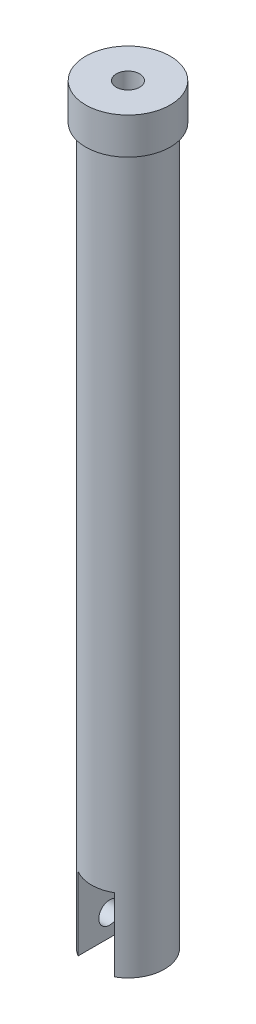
ISO-10303-21;
HEADER;
FILE_DESCRIPTION(('STEP AP214'),'2;1');
FILE_NAME('part.step','',(''),(''),'','','');
FILE_SCHEMA(('AUTOMOTIVE_DESIGN { 1 0 10303 214 1 1 1 1 }'));
ENDSEC;
DATA;
#1=APPLICATION_CONTEXT('core data for automotive mechanical design processes');
#2=APPLICATION_PROTOCOL_DEFINITION('international standard','automotive_design',2000,#1);
#3=PRODUCT_CONTEXT('',#1,'mechanical');
#4=PRODUCT('Part','Part','',(#3));
#5=PRODUCT_RELATED_PRODUCT_CATEGORY('part','',(#4));
#6=PRODUCT_DEFINITION_FORMATION('','',#4);
#7=PRODUCT_DEFINITION_CONTEXT('part definition',#1,'design');
#8=PRODUCT_DEFINITION('design','',#6,#7);
#9=PRODUCT_DEFINITION_SHAPE('','',#8);
#10=(LENGTH_UNIT() NAMED_UNIT(*) SI_UNIT(.MILLI.,.METRE.));
#11=(NAMED_UNIT(*) PLANE_ANGLE_UNIT() SI_UNIT($,.RADIAN.));
#12=(NAMED_UNIT(*) SI_UNIT($,.STERADIAN.) SOLID_ANGLE_UNIT());
#13=UNCERTAINTY_MEASURE_WITH_UNIT(LENGTH_MEASURE(1.E-05),#10,'distance_accuracy_value','');
#14=(GEOMETRIC_REPRESENTATION_CONTEXT(3) GLOBAL_UNCERTAINTY_ASSIGNED_CONTEXT((#13)) GLOBAL_UNIT_ASSIGNED_CONTEXT((#10,
#11,#12)) REPRESENTATION_CONTEXT('',''));
#15=CARTESIAN_POINT('',(0.,0.,0.));
#16=DIRECTION('',(0.,0.,1.));
#17=DIRECTION('',(1.,0.,0.));
#18=AXIS2_PLACEMENT_3D('',#15,#16,#17);
#19=CARTESIAN_POINT('',(0.,875.,0.));
#20=DIRECTION('',(0.,-1.,0.));
#21=DIRECTION('',(0.,0.,-1.));
#22=AXIS2_PLACEMENT_3D('',#19,#20,#21);
#23=CYLINDRICAL_SURFACE('',#22,50.);
#24=CARTESIAN_POINT('',(0.,-5.,0.));
#25=DIRECTION('',(0.,-1.,0.));
#26=DIRECTION('',(0.,0.,-1.));
#27=AXIS2_PLACEMENT_3D('',#24,#25,#26);
#28=CIRCLE('',#27,50.);
#29=CARTESIAN_POINT('',(-25.,-5.,-43.3012701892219));
#30=VERTEX_POINT('',#29);
#31=CARTESIAN_POINT('',(25.,-5.,-43.3012701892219));
#32=VERTEX_POINT('',#31);
#33=EDGE_CURVE('E125',#30,#32,#28,.T.);
#34=ORIENTED_EDGE('',*,*,#33,.F.);
#35=DIRECTION('',(0.,1.,0.));
#36=VECTOR('',#35,1.);
#37=CARTESIAN_POINT('',(-25.,-105.,-43.3012701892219));
#38=LINE('',#37,#36);
#39=CARTESIAN_POINT('',(-25.,-105.,-43.3012701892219));
#40=VERTEX_POINT('',#39);
#41=EDGE_CURVE('E128',#40,#30,#38,.T.);
#42=ORIENTED_EDGE('',*,*,#41,.F.);
#43=CARTESIAN_POINT('',(0.,-105.,0.));
#44=DIRECTION('',(0.,-1.,0.));
#45=DIRECTION('',(0.,0.,-1.));
#46=AXIS2_PLACEMENT_3D('',#43,#44,#45);
#47=CIRCLE('',#46,50.);
#48=CARTESIAN_POINT('',(-25.,-105.,43.3012701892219));
#49=VERTEX_POINT('',#48);
#50=EDGE_CURVE('E111',#49,#40,#47,.T.);
#51=ORIENTED_EDGE('',*,*,#50,.F.);
#52=DIRECTION('',(0.,1.,0.));
#53=VECTOR('',#52,1.);
#54=CARTESIAN_POINT('',(-25.,-105.,43.3012701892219));
#55=LINE('',#54,#53);
#56=CARTESIAN_POINT('',(-25.,-5.,43.3012701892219));
#57=VERTEX_POINT('',#56);
#58=EDGE_CURVE('E120',#49,#57,#55,.T.);
#59=ORIENTED_EDGE('',*,*,#58,.T.);
#60=CARTESIAN_POINT('',(25.,-5.,43.3012701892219));
#61=VERTEX_POINT('',#60);
#62=EDGE_CURVE('E109',#61,#57,#28,.T.);
#63=ORIENTED_EDGE('',*,*,#62,.F.);
#64=DIRECTION('',(0.,1.,0.));
#65=VECTOR('',#64,1.);
#66=CARTESIAN_POINT('',(25.,-105.,43.3012701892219));
#67=LINE('',#66,#65);
#68=CARTESIAN_POINT('',(25.,-105.,43.3012701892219));
#69=VERTEX_POINT('',#68);
#70=EDGE_CURVE('E67',#69,#61,#67,.T.);
#71=ORIENTED_EDGE('',*,*,#70,.F.);
#72=CARTESIAN_POINT('',(0.,-105.,0.));
#73=DIRECTION('',(0.,-1.,0.));
#74=DIRECTION('',(0.,0.,-1.));
#75=AXIS2_PLACEMENT_3D('',#72,#73,#74);
#76=CIRCLE('',#75,50.);
#77=CARTESIAN_POINT('',(25.,-105.,-43.3012701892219));
#78=VERTEX_POINT('',#77);
#79=EDGE_CURVE('E100',#78,#69,#76,.T.);
#80=ORIENTED_EDGE('',*,*,#79,.F.);
#81=DIRECTION('',(0.,1.,0.));
#82=VECTOR('',#81,1.);
#83=CARTESIAN_POINT('',(25.,-105.,-43.3012701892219));
#84=LINE('',#83,#82);
#85=EDGE_CURVE('E97',#78,#32,#84,.T.);
#86=ORIENTED_EDGE('',*,*,#85,.T.);
#87=EDGE_LOOP('',(#34,#42,#51,#59,#63,#71,#80,#86));
#88=FACE_BOUND('',#87,.T.);
#89=CARTESIAN_POINT('',(0.,875.,0.));
#90=DIRECTION('',(0.,1.,0.));
#91=DIRECTION('',(0.,0.,1.));
#92=AXIS2_PLACEMENT_3D('',#89,#90,#91);
#93=CIRCLE('',#92,50.);
#94=CARTESIAN_POINT('',(0.,875.,50.));
#95=VERTEX_POINT('',#94);
#96=EDGE_CURVE('E13',#95,#95,#93,.T.);
#97=ORIENTED_EDGE('',*,*,#96,.F.);
#98=EDGE_LOOP('',(#97));
#99=FACE_BOUND('',#98,.T.);
#100=CARTESIAN_POINT('',(-47.6969600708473,-75.,15.));
#101=CARTESIAN_POINT('',(-47.6969606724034,-74.5890111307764,14.9999991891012));
#102=CARTESIAN_POINT('',(-47.7022865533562,-74.1780081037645,14.9830945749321));
#103=CARTESIAN_POINT('',(-47.7234235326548,-73.3590372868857,14.9156320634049));
#104=CARTESIAN_POINT('',(-47.7392351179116,-72.9510696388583,14.86507260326));
#105=CARTESIAN_POINT('',(-47.7808538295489,-72.1410395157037,14.730748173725));
#106=CARTESIAN_POINT('',(-47.8066638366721,-71.7389787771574,14.6469736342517));
#107=CARTESIAN_POINT('',(-47.8674843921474,-70.9437376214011,14.4469666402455));
#108=CARTESIAN_POINT('',(-47.9024948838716,-70.5505571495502,14.3307343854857));
#109=CARTESIAN_POINT('',(-47.9805982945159,-69.7764103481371,14.0670197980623));
#110=CARTESIAN_POINT('',(-48.0236773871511,-69.3954244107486,13.9195908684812));
#111=CARTESIAN_POINT('',(-48.1167044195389,-68.6474432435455,13.5945325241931));
#112=CARTESIAN_POINT('',(-48.1666523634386,-68.280448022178,13.4169030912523));
#113=CARTESIAN_POINT('',(-48.2720144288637,-67.5627001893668,13.0327386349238));
#114=CARTESIAN_POINT('',(-48.3274290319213,-67.2119490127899,12.8262010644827));
#115=CARTESIAN_POINT('',(-48.4422081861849,-66.5288170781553,12.3856475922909));
#116=CARTESIAN_POINT('',(-48.5015729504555,-66.196437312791,12.1516302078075));
#117=CARTESIAN_POINT('',(-48.6244076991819,-65.54277956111,11.650553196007));
#118=CARTESIAN_POINT('',(-48.6879465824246,-65.2220929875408,11.3827386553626));
#119=CARTESIAN_POINT('',(-48.8157802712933,-64.6042422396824,10.8213882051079));
#120=CARTESIAN_POINT('',(-48.8800750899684,-64.3070784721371,10.5278518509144));
#121=CARTESIAN_POINT('',(-49.0076845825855,-63.7381158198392,9.91686644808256));
#122=CARTESIAN_POINT('',(-49.0709991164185,-63.4663205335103,9.59941401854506));
#123=CARTESIAN_POINT('',(-49.1949304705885,-62.949936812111,8.9426215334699));
#124=CARTESIAN_POINT('',(-49.255547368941,-62.7053475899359,8.60328211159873));
#125=CARTESIAN_POINT('',(-49.373666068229,-62.2402762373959,7.89757572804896));
#126=CARTESIAN_POINT('',(-49.4310771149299,-62.0203997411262,7.53079401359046));
#127=CARTESIAN_POINT('',(-49.5397653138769,-61.6124303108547,6.77907492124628));
#128=CARTESIAN_POINT('',(-49.5910423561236,-61.4243379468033,6.39413721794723));
#129=CARTESIAN_POINT('',(-49.6859862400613,-61.0815098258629,5.60884546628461));
#130=CARTESIAN_POINT('',(-49.7296543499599,-60.9267685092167,5.20849400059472));
#131=CARTESIAN_POINT('',(-49.8081209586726,-60.6519592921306,4.39521812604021));
#132=CARTESIAN_POINT('',(-49.8429197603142,-60.531890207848,3.98229414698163));
#133=CARTESIAN_POINT('',(-49.9017691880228,-60.3304540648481,3.15893611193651));
#134=CARTESIAN_POINT('',(-49.9260987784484,-60.2480782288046,2.74876867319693));
#135=CARTESIAN_POINT('',(-49.9647368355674,-60.1178359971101,1.92252240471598));
#136=CARTESIAN_POINT('',(-49.9790454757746,-60.0699690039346,1.50644367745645));
#137=CARTESIAN_POINT('',(-49.9972325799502,-60.0091992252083,0.671588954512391));
#138=CARTESIAN_POINT('',(-50.0011129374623,-59.9962900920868,0.252813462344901));
#139=CARTESIAN_POINT('',(-49.9983376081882,-60.0055414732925,-0.584310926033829));
#140=CARTESIAN_POINT('',(-49.9916821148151,-60.0277013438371,-1.00265982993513));
#141=CARTESIAN_POINT('',(-49.9684046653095,-60.1056123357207,-1.82244642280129));
#142=CARTESIAN_POINT('',(-49.9521073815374,-60.1602694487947,-2.22399789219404));
#143=CARTESIAN_POINT('',(-49.9102538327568,-60.3017687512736,-3.02088653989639));
#144=CARTESIAN_POINT('',(-49.8846977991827,-60.3886101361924,-3.41622387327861));
#145=CARTESIAN_POINT('',(-49.8249991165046,-60.593745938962,-4.19799578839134));
#146=CARTESIAN_POINT('',(-49.7908561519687,-60.7120415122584,-4.58443004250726));
#147=CARTESIAN_POINT('',(-49.7148719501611,-60.9791272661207,-5.3458305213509));
#148=CARTESIAN_POINT('',(-49.6730305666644,-61.1279180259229,-5.72079652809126));
#149=CARTESIAN_POINT('',(-49.582197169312,-61.4567534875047,-6.46114855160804));
#150=CARTESIAN_POINT('',(-49.5331277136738,-61.6371412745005,-6.82637261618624));
#151=CARTESIAN_POINT('',(-49.4294777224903,-62.0266237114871,-7.5403502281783));
#152=CARTESIAN_POINT('',(-49.3748971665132,-62.2357184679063,-7.88910371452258));
#153=CARTESIAN_POINT('',(-49.2616103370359,-62.6812073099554,-8.56809494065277));
#154=CARTESIAN_POINT('',(-49.202903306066,-62.9176064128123,-8.89832926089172));
#155=CARTESIAN_POINT('',(-49.0828620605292,-63.4161375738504,-9.53827363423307));
#156=CARTESIAN_POINT('',(-49.0215277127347,-63.678270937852,-9.84798264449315));
#157=CARTESIAN_POINT('',(-48.8954033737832,-64.2372209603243,-10.4565672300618));
#158=CARTESIAN_POINT('',(-48.8305713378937,-64.534985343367,-10.7545643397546));
#159=CARTESIAN_POINT('',(-48.7015424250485,-65.1545933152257,-11.3245385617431));
#160=CARTESIAN_POINT('',(-48.6373455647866,-65.4764375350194,-11.596514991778));
#161=CARTESIAN_POINT('',(-48.5113765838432,-66.1422073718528,-12.1126770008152));
#162=CARTESIAN_POINT('',(-48.4496047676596,-66.486135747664,-12.3568590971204));
#163=CARTESIAN_POINT('',(-48.3302648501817,-67.1938408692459,-12.8156822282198));
#164=CARTESIAN_POINT('',(-48.2726965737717,-67.5576167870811,-13.0303244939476));
#165=CARTESIAN_POINT('',(-48.1629264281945,-68.3062806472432,-13.4304128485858));
#166=CARTESIAN_POINT('',(-48.1107817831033,-68.6913386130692,-13.6155568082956));
#167=CARTESIAN_POINT('',(-48.014115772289,-69.4766738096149,-13.9526145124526));
#168=CARTESIAN_POINT('',(-47.9695944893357,-69.87695120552,-14.1045278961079));
#169=CARTESIAN_POINT('',(-47.8896104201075,-70.6897478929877,-14.3737591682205));
#170=CARTESIAN_POINT('',(-47.8541452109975,-71.1022638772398,-14.4910863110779));
#171=CARTESIAN_POINT('',(-47.7934279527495,-71.9365399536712,-14.6901019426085));
#172=CARTESIAN_POINT('',(-47.7681754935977,-72.3582996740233,-14.7717918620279));
#173=CARTESIAN_POINT('',(-47.729469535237,-73.1919301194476,-14.8963695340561));
#174=CARTESIAN_POINT('',(-47.7156112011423,-73.6035832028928,-14.9405905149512));
#175=CARTESIAN_POINT('',(-47.698587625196,-74.4293535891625,-14.9948510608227));
#176=CARTESIAN_POINT('',(-47.6954221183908,-74.8434708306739,-15.0048914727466));
#177=CARTESIAN_POINT('',(-47.699885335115,-75.6710038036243,-14.990696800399));
#178=CARTESIAN_POINT('',(-47.7075126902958,-76.0844196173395,-14.9664660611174));
#179=CARTESIAN_POINT('',(-47.7333150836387,-76.9075038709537,-14.8839676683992));
#180=CARTESIAN_POINT('',(-47.7514900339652,-77.3171723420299,-14.8257002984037));
#181=CARTESIAN_POINT('',(-47.7972074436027,-78.1191590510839,-14.6776285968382));
#182=CARTESIAN_POINT('',(-47.824493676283,-78.5116513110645,-14.588684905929));
#183=CARTESIAN_POINT('',(-47.8877196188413,-79.2875649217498,-14.3797846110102));
#184=CARTESIAN_POINT('',(-47.9236591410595,-79.6709864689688,-14.2598286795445));
#185=CARTESIAN_POINT('',(-48.0031648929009,-80.4263185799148,-13.989851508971));
#186=CARTESIAN_POINT('',(-48.0467319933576,-80.7982278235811,-13.8398268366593));
#187=CARTESIAN_POINT('',(-48.1402758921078,-81.52818633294,-13.5108498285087));
#188=CARTESIAN_POINT('',(-48.1902528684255,-81.8862352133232,-13.3318966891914));
#189=CARTESIAN_POINT('',(-48.2966745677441,-82.5957278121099,-12.9411477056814));
#190=CARTESIAN_POINT('',(-48.3532568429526,-82.9467365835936,-12.728599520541));
#191=CARTESIAN_POINT('',(-48.4701889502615,-83.6297423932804,-12.275806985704));
#192=CARTESIAN_POINT('',(-48.530538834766,-83.9617391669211,-12.0355622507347));
#193=CARTESIAN_POINT('',(-48.653392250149,-84.6048022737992,-11.5288927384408));
#194=CARTESIAN_POINT('',(-48.7158962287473,-84.9158642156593,-11.2624624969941));
#195=CARTESIAN_POINT('',(-48.8413955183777,-85.5151213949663,-10.7051233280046));
#196=CARTESIAN_POINT('',(-48.9043908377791,-85.8033162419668,-10.4142139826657));
#197=CARTESIAN_POINT('',(-49.0315925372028,-86.3655119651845,-9.79823995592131));
#198=CARTESIAN_POINT('',(-49.0957547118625,-86.6385647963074,-9.47229995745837));
#199=CARTESIAN_POINT('',(-49.2210528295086,-87.15628013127,-8.79804089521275));
#200=CARTESIAN_POINT('',(-49.2821886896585,-87.4009418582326,-8.44972121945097));
#201=CARTESIAN_POINT('',(-49.3997255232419,-87.8600991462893,-7.7329796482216));
#202=CARTESIAN_POINT('',(-49.4561266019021,-88.0745953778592,-7.36455819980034));
#203=CARTESIAN_POINT('',(-49.5626076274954,-88.4717740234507,-6.61007136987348));
#204=CARTESIAN_POINT('',(-49.6126876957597,-88.6544570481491,-6.22400632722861));
#205=CARTESIAN_POINT('',(-49.704749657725,-88.9852492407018,-5.43989725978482));
#206=CARTESIAN_POINT('',(-49.7467902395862,-89.1336107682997,-5.04196665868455));
#207=CARTESIAN_POINT('',(-49.8220449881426,-89.3962498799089,-4.23418833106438));
#208=CARTESIAN_POINT('',(-49.8552591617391,-89.5105274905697,-3.82434061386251));
#209=CARTESIAN_POINT('',(-49.9118936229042,-89.7039342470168,-2.9958665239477));
#210=CARTESIAN_POINT('',(-49.9353162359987,-89.7830717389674,-2.57724226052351));
#211=CARTESIAN_POINT('',(-49.971691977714,-89.9054831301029,-1.73433631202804));
#212=CARTESIAN_POINT('',(-49.9846454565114,-89.9487582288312,-1.31005481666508));
#213=CARTESIAN_POINT('',(-49.9994123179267,-89.9980581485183,-0.475570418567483));
#214=CARTESIAN_POINT('',(-50.00163583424,-90.0054544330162,-0.0654551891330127));
#215=CARTESIAN_POINT('',(-49.9959941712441,-89.9866446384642,0.753926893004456));
#216=CARTESIAN_POINT('',(-49.9881292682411,-89.9604394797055,1.16319376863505));
#217=CARTESIAN_POINT('',(-49.9625270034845,-89.8746688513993,1.97787465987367));
#218=CARTESIAN_POINT('',(-49.9447902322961,-89.8151053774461,2.38328890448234));
#219=CARTESIAN_POINT('',(-49.899927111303,-89.6631507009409,3.18738597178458));
#220=CARTESIAN_POINT('',(-49.8728007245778,-89.5707593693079,3.58606876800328));
#221=CARTESIAN_POINT('',(-49.8102283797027,-89.3551164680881,4.36966666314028));
#222=CARTESIAN_POINT('',(-49.7748752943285,-89.2322084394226,4.75468386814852));
#223=CARTESIAN_POINT('',(-49.6966149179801,-88.9560402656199,5.51286866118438));
#224=CARTESIAN_POINT('',(-49.6537077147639,-88.8027804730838,5.88603638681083));
#225=CARTESIAN_POINT('',(-49.5614319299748,-88.4670551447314,6.61820550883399));
#226=CARTESIAN_POINT('',(-49.51206263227,-88.2845863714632,6.97720532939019));
#227=CARTESIAN_POINT('',(-49.4081111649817,-87.8917537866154,7.67882469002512));
#228=CARTESIAN_POINT('',(-49.3535287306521,-87.6813885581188,8.02144339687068));
#229=CARTESIAN_POINT('',(-49.2387068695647,-87.2270230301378,8.69893927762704));
#230=CARTESIAN_POINT('',(-49.1783423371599,-86.982162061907,9.03321823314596));
#231=CARTESIAN_POINT('',(-49.0551105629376,-86.465892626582,9.68011207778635));
#232=CARTESIAN_POINT('',(-48.9922432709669,-86.1944836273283,9.99272653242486));
#233=CARTESIAN_POINT('',(-48.8656662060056,-85.6268464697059,10.5943945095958));
#234=CARTESIAN_POINT('',(-48.8019563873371,-85.3306169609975,10.8834467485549));
#235=CARTESIAN_POINT('',(-48.6753695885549,-84.7150578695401,11.4362960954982));
#236=CARTESIAN_POINT('',(-48.6124929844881,-84.3957182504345,11.7000821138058));
#237=CARTESIAN_POINT('',(-48.4874632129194,-83.726135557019,12.208045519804));
#238=CARTESIAN_POINT('',(-48.4253877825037,-83.3752542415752,12.4514016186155));
#239=CARTESIAN_POINT('',(-48.3058104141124,-82.6536167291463,12.9075276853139));
#240=CARTESIAN_POINT('',(-48.2483065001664,-82.2828692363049,13.1203109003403));
#241=CARTESIAN_POINT('',(-48.1395906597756,-81.5238942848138,13.5137515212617));
#242=CARTESIAN_POINT('',(-48.0883776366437,-81.1356698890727,13.6944145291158));
#243=CARTESIAN_POINT('',(-47.9938354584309,-80.3443855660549,14.0221568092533));
#244=CARTESIAN_POINT('',(-47.9505055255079,-79.941327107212,14.1692393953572));
#245=CARTESIAN_POINT('',(-47.8772996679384,-79.1674691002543,14.4145316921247));
#246=CARTESIAN_POINT('',(-47.8464763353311,-78.7978838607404,14.5163031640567));
#247=CARTESIAN_POINT('',(-47.7930209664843,-78.0514550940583,14.691342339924));
#248=CARTESIAN_POINT('',(-47.7703882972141,-77.6746121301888,14.7646122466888));
#249=CARTESIAN_POINT('',(-47.7339272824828,-76.9160625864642,14.8820689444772));
#250=CARTESIAN_POINT('',(-47.7200974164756,-76.5343568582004,14.9262607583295));
#251=CARTESIAN_POINT('',(-47.7016132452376,-75.7684383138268,14.9852275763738));
#252=CARTESIAN_POINT('',(-47.6969595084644,-75.3842253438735,15.0000007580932));
#253=CARTESIAN_POINT('',(-47.6969600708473,-75.,15.));
#254=B_SPLINE_CURVE_WITH_KNOTS('',3,(#100,#101,#102,#103,#104,#105,#106,#107,#108,#109,#110,
#111,#112,#113,#114,#115,#116,#117,#118,#119,#120,#121,#122,#123,#124,#125,#126,#127,#128,#129,
#130,#131,#132,#133,#134,#135,#136,#137,#138,#139,#140,#141,#142,#143,#144,#145,#146,#147,#148,
#149,#150,#151,#152,#153,#154,#155,#156,#157,#158,#159,#160,#161,#162,#163,#164,#165,#166,#167,
#168,#169,#170,#171,#172,#173,#174,#175,#176,#177,#178,#179,#180,#181,#182,#183,#184,#185,#186,
#187,#188,#189,#190,#191,#192,#193,#194,#195,#196,#197,#198,#199,#200,#201,#202,#203,#204,#205,
#206,#207,#208,#209,#210,#211,#212,#213,#214,#215,#216,#217,#218,#219,#220,#221,#222,#223,#224,
#225,#226,#227,#228,#229,#230,#231,#232,#233,#234,#235,#236,#237,#238,#239,#240,#241,#242,#243,
#244,#245,#246,#247,#248,#249,#250,#251,#252,#253),.UNSPECIFIED.,.T.,.F.,(4,2,2,2,2,2,2,2,2,2,2,
2,2,2,2,2,2,2,2,2,2,2,2,2,2,2,2,2,2,2,2,2,2,2,2,2,2,2,2,2,2,2,2,2,2,2,2,2,2,2,2,2,2,2,2,2,2,2,2,
2,2,2,2,2,2,2,2,2,2,2,2,2,2,2,2,2,4),(0.,1.23261087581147,2.46527899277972,3.69830253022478,
4.93131847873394,6.16224055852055,7.39316338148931,8.62419472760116,9.85529252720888,
11.1216825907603,12.3880945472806,13.654685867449,14.9212405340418,16.2140799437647,
17.5069425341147,18.7995894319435,20.0921921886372,21.3478219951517,22.603430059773,
23.8588101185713,25.1141671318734,26.3294819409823,27.54476637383,28.7600954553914,
29.9754476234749,31.2049223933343,32.4344017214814,33.6641073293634,34.8938753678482,
36.1710714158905,37.4483009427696,38.7256903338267,40.0030264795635,41.292704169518,
42.5823958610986,43.8717421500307,45.1610366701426,46.4022577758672,47.6434481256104,
48.8844811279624,50.1255037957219,51.3342135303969,52.5428970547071,53.7517186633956,
54.9605738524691,56.20186212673,57.4431676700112,58.6847327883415,59.9263191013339,
61.2148280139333,62.5033721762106,63.7918876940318,65.0803784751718,66.3590706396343,
67.6377618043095,68.9161491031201,70.1944936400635,71.4235664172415,72.6526055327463,
73.881571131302,75.1105415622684,76.3262587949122,77.541961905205,78.7577998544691,
79.9736995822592,81.2284936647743,82.4833129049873,83.7382004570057,84.993636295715,
86.2865799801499,87.5789617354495,88.8711178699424,90.1631464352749,91.3157067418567,
92.4681779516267,93.6204500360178,94.7727935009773),.UNSPECIFIED.);
#255=CARTESIAN_POINT('',(-47.6969600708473,-75.,15.));
#256=VERTEX_POINT('',#255);
#257=EDGE_CURVE('E193',#256,#256,#254,.T.);
#258=ORIENTED_EDGE('',*,*,#257,.F.);
#259=EDGE_LOOP('',(#258));
#260=FACE_BOUND('',#259,.T.);
#261=ADVANCED_FACE('F50',(#88,#99,#260),#23,.T.);
#262=CARTESIAN_POINT('',(-25.,-105.,43.3012701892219));
#263=DIRECTION('',(-1.,0.,0.));
#264=DIRECTION('',(0.,0.,1.));
#265=AXIS2_PLACEMENT_3D('',#262,#263,#264);
#266=PLANE('',#265);
#267=DIRECTION('',(0.,0.,1.));
#268=VECTOR('',#267,1.);
#269=CARTESIAN_POINT('',(-25.,-5.,43.3012701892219));
#270=LINE('',#269,#268);
#271=EDGE_CURVE('E75',#30,#57,#270,.T.);
#272=ORIENTED_EDGE('',*,*,#271,.T.);
#273=ORIENTED_EDGE('',*,*,#58,.F.);
#274=DIRECTION('',(0.,0.,1.));
#275=VECTOR('',#274,1.);
#276=CARTESIAN_POINT('',(-25.,-105.,43.3012701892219));
#277=LINE('',#276,#275);
#278=EDGE_CURVE('E118',#40,#49,#277,.T.);
#279=ORIENTED_EDGE('',*,*,#278,.F.);
#280=ORIENTED_EDGE('',*,*,#41,.T.);
#281=EDGE_LOOP('',(#272,#273,#279,#280));
#282=FACE_BOUND('',#281,.T.);
#283=CARTESIAN_POINT('',(-25.,-75.,0.));
#284=DIRECTION('',(-1.,0.,0.));
#285=DIRECTION('',(0.,0.,1.));
#286=AXIS2_PLACEMENT_3D('',#283,#284,#285);
#287=CIRCLE('',#286,15.);
#288=CARTESIAN_POINT('',(-25.,-75.,15.));
#289=VERTEX_POINT('',#288);
#290=EDGE_CURVE('E198',#289,#289,#287,.F.);
#291=ORIENTED_EDGE('',*,*,#290,.F.);
#292=EDGE_LOOP('',(#291));
#293=FACE_BOUND('',#292,.T.);
#294=ADVANCED_FACE('F151',(#282,#293),#266,.F.);
#295=CARTESIAN_POINT('',(25.,-105.,43.3012701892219));
#296=DIRECTION('',(1.,0.,0.));
#297=DIRECTION('',(0.,0.,-1.));
#298=AXIS2_PLACEMENT_3D('',#295,#296,#297);
#299=PLANE('',#298);
#300=DIRECTION('',(0.,0.,-1.));
#301=VECTOR('',#300,1.);
#302=CARTESIAN_POINT('',(25.,-5.,43.3012701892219));
#303=LINE('',#302,#301);
#304=EDGE_CURVE('E104',#61,#32,#303,.T.);
#305=ORIENTED_EDGE('',*,*,#304,.T.);
#306=ORIENTED_EDGE('',*,*,#85,.F.);
#307=DIRECTION('',(0.,0.,-1.));
#308=VECTOR('',#307,1.);
#309=CARTESIAN_POINT('',(25.,-105.,43.3012701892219));
#310=LINE('',#309,#308);
#311=EDGE_CURVE('E92',#69,#78,#310,.T.);
#312=ORIENTED_EDGE('',*,*,#311,.F.);
#313=ORIENTED_EDGE('',*,*,#70,.T.);
#314=EDGE_LOOP('',(#305,#306,#312,#313));
#315=FACE_BOUND('',#314,.T.);
#316=CARTESIAN_POINT('',(25.,-75.,0.));
#317=DIRECTION('',(1.,0.,0.));
#318=DIRECTION('',(0.,0.,-1.));
#319=AXIS2_PLACEMENT_3D('',#316,#317,#318);
#320=CIRCLE('',#319,15.);
#321=CARTESIAN_POINT('',(25.,-75.,15.));
#322=VERTEX_POINT('',#321);
#323=EDGE_CURVE('E54',#322,#322,#320,.F.);
#324=ORIENTED_EDGE('',*,*,#323,.F.);
#325=EDGE_LOOP('',(#324));
#326=FACE_BOUND('',#325,.T.);
#327=ADVANCED_FACE('F94',(#315,#326),#299,.F.);
#328=CARTESIAN_POINT('',(0.,-5.,0.));
#329=DIRECTION('',(0.,-1.,0.));
#330=DIRECTION('',(0.,0.,-1.));
#331=AXIS2_PLACEMENT_3D('',#328,#329,#330);
#332=PLANE('',#331);
#333=ORIENTED_EDGE('',*,*,#33,.T.);
#334=ORIENTED_EDGE('',*,*,#304,.F.);
#335=ORIENTED_EDGE('',*,*,#62,.T.);
#336=ORIENTED_EDGE('',*,*,#271,.F.);
#337=EDGE_LOOP('',(#333,#334,#335,#336));
#338=FACE_BOUND('',#337,.T.);
#339=ADVANCED_FACE('F160',(#338),#332,.T.);
#340=CARTESIAN_POINT('',(0.,-105.,0.));
#341=DIRECTION('',(0.,-1.,0.));
#342=DIRECTION('',(0.,0.,-1.));
#343=AXIS2_PLACEMENT_3D('',#340,#341,#342);
#344=PLANE('',#343);
#345=ORIENTED_EDGE('',*,*,#50,.T.);
#346=ORIENTED_EDGE('',*,*,#278,.T.);
#347=EDGE_LOOP('',(#345,#346));
#348=FACE_BOUND('',#347,.T.);
#349=ADVANCED_FACE('F165',(#348),#344,.T.);
#350=CARTESIAN_POINT('',(0.,-105.,0.));
#351=DIRECTION('',(0.,-1.,0.));
#352=DIRECTION('',(0.,0.,-1.));
#353=AXIS2_PLACEMENT_3D('',#350,#351,#352);
#354=PLANE('',#353);
#355=ORIENTED_EDGE('',*,*,#79,.T.);
#356=ORIENTED_EDGE('',*,*,#311,.T.);
#357=EDGE_LOOP('',(#355,#356));
#358=FACE_BOUND('',#357,.T.);
#359=ADVANCED_FACE('F102',(#358),#354,.T.);
#360=CARTESIAN_POINT('',(45.,-75.,0.));
#361=DIRECTION('',(1.,0.,0.));
#362=DIRECTION('',(0.,0.,-1.));
#363=AXIS2_PLACEMENT_3D('',#360,#361,#362);
#364=PLANE('',#363);
#365=CARTESIAN_POINT('',(45.,-75.,0.));
#366=DIRECTION('',(1.,0.,0.));
#367=DIRECTION('',(0.,0.,-1.));
#368=AXIS2_PLACEMENT_3D('',#365,#366,#367);
#369=CIRCLE('',#368,15.);
#370=CARTESIAN_POINT('',(45.,-75.,15.));
#371=VERTEX_POINT('',#370);
#372=EDGE_CURVE('E201',#371,#371,#369,.T.);
#373=ORIENTED_EDGE('',*,*,#372,.F.);
#374=EDGE_LOOP('',(#373));
#375=FACE_BOUND('',#374,.T.);
#376=ADVANCED_FACE('F174',(#375),#364,.F.);
#377=CARTESIAN_POINT('',(45.,-75.,0.));
#378=DIRECTION('',(-1.,0.,0.));
#379=DIRECTION('',(0.,0.,1.));
#380=AXIS2_PLACEMENT_3D('',#377,#378,#379);
#381=CYLINDRICAL_SURFACE('',#380,15.);
#382=CARTESIAN_POINT('',(45.,-75.,15.));
#383=CARTESIAN_POINT('',(44.7916666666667,-75.,15.));
#384=CARTESIAN_POINT('',(44.5833333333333,-75.,15.));
#385=CARTESIAN_POINT('',(44.1666666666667,-75.,15.));
#386=CARTESIAN_POINT('',(43.9583333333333,-75.,15.));
#387=CARTESIAN_POINT('',(43.5416666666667,-75.,15.));
#388=CARTESIAN_POINT('',(43.3333333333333,-75.,15.));
#389=CARTESIAN_POINT('',(42.9166666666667,-75.,15.));
#390=CARTESIAN_POINT('',(42.7083333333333,-75.,15.));
#391=CARTESIAN_POINT('',(42.2916666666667,-75.,15.));
#392=CARTESIAN_POINT('',(42.0833333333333,-75.,15.));
#393=CARTESIAN_POINT('',(41.6666666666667,-75.,15.));
#394=CARTESIAN_POINT('',(41.4583333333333,-75.,15.));
#395=CARTESIAN_POINT('',(41.0416666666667,-75.,15.));
#396=CARTESIAN_POINT('',(40.8333333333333,-75.,15.));
#397=CARTESIAN_POINT('',(40.4166666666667,-75.,15.));
#398=CARTESIAN_POINT('',(40.2083333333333,-75.,15.));
#399=CARTESIAN_POINT('',(39.7916666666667,-75.,15.));
#400=CARTESIAN_POINT('',(39.5833333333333,-75.,15.));
#401=CARTESIAN_POINT('',(39.1666666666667,-75.,15.));
#402=CARTESIAN_POINT('',(38.9583333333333,-75.,15.));
#403=CARTESIAN_POINT('',(38.5416666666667,-75.,15.));
#404=CARTESIAN_POINT('',(38.3333333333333,-75.,15.));
#405=CARTESIAN_POINT('',(37.9166666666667,-75.,15.));
#406=CARTESIAN_POINT('',(37.7083333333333,-75.,15.));
#407=CARTESIAN_POINT('',(37.2916666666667,-75.,15.));
#408=CARTESIAN_POINT('',(37.0833333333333,-75.,15.));
#409=CARTESIAN_POINT('',(36.6666666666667,-75.,15.));
#410=CARTESIAN_POINT('',(36.4583333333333,-75.,15.));
#411=CARTESIAN_POINT('',(36.0416666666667,-75.,15.));
#412=CARTESIAN_POINT('',(35.8333333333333,-75.,15.));
#413=CARTESIAN_POINT('',(35.4166666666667,-75.,15.));
#414=CARTESIAN_POINT('',(35.2083333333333,-75.,15.));
#415=CARTESIAN_POINT('',(34.7916666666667,-75.,15.));
#416=CARTESIAN_POINT('',(34.5833333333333,-75.,15.));
#417=CARTESIAN_POINT('',(34.1666666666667,-75.,15.));
#418=CARTESIAN_POINT('',(33.9583333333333,-75.,15.));
#419=CARTESIAN_POINT('',(33.5416666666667,-75.,15.));
#420=CARTESIAN_POINT('',(33.3333333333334,-75.,15.));
#421=CARTESIAN_POINT('',(32.9166666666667,-75.,15.));
#422=CARTESIAN_POINT('',(32.7083333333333,-75.,15.));
#423=CARTESIAN_POINT('',(32.2916666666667,-75.,15.));
#424=CARTESIAN_POINT('',(32.0833333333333,-75.,15.));
#425=CARTESIAN_POINT('',(31.6666666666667,-75.,15.));
#426=CARTESIAN_POINT('',(31.4583333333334,-75.,15.));
#427=CARTESIAN_POINT('',(31.0416666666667,-75.,15.));
#428=CARTESIAN_POINT('',(30.8333333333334,-75.,15.));
#429=CARTESIAN_POINT('',(30.4166666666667,-75.,15.));
#430=CARTESIAN_POINT('',(30.2083333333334,-75.,15.));
#431=CARTESIAN_POINT('',(29.7916666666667,-75.,15.));
#432=CARTESIAN_POINT('',(29.5833333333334,-75.,15.));
#433=CARTESIAN_POINT('',(29.1666666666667,-75.,15.));
#434=CARTESIAN_POINT('',(28.9583333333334,-75.,15.));
#435=CARTESIAN_POINT('',(28.5416666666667,-75.,15.));
#436=CARTESIAN_POINT('',(28.3333333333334,-75.,15.));
#437=CARTESIAN_POINT('',(27.9166666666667,-75.,15.));
#438=CARTESIAN_POINT('',(27.7083333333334,-75.,15.));
#439=CARTESIAN_POINT('',(27.2916666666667,-75.,15.));
#440=CARTESIAN_POINT('',(27.0833333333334,-75.,15.));
#441=CARTESIAN_POINT('',(26.6666666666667,-75.,15.));
#442=CARTESIAN_POINT('',(26.4583333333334,-75.,15.));
#443=CARTESIAN_POINT('',(26.0416666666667,-75.,15.));
#444=CARTESIAN_POINT('',(25.8333333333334,-75.,15.));
#445=CARTESIAN_POINT('',(25.4166666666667,-75.,15.));
#446=CARTESIAN_POINT('',(25.2083333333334,-75.,15.));
#447=CARTESIAN_POINT('',(25.,-75.,15.));
#448=B_SPLINE_CURVE_WITH_KNOTS('',3,(#382,#383,#384,#385,#386,#387,#388,#389,#390,#391,#392,
#393,#394,#395,#396,#397,#398,#399,#400,#401,#402,#403,#404,#405,#406,#407,#408,#409,#410,#411,
#412,#413,#414,#415,#416,#417,#418,#419,#420,#421,#422,#423,#424,#425,#426,#427,#428,#429,#430,
#431,#432,#433,#434,#435,#436,#437,#438,#439,#440,#441,#442,#443,#444,#445,#446,#447),
.UNSPECIFIED.,.F.,.F.,(4,2,2,2,2,2,2,2,2,2,2,2,2,2,2,2,2,2,2,2,2,2,2,2,2,2,2,2,2,2,2,2,4),(0.,
0.625000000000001,1.25,1.875,2.5,3.125,3.75,4.37499999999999,4.99999999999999,5.62499999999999,
6.24999999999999,6.87499999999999,7.49999999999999,8.12499999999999,8.74999999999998,
9.37499999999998,9.99999999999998,10.625,11.25,11.875,12.5,13.125,13.75,14.375,15.,15.625,16.25,
16.875,17.5,18.125,18.75,19.375,20.),.UNSPECIFIED.);
#449=EDGE_CURVE('BSEAM182',#371,#322,#448,.T.);
#450=ORIENTED_EDGE('',*,*,#372,.T.);
#451=ORIENTED_EDGE('',*,*,#323,.T.);
#452=ORIENTED_EDGE('',*,*,#449,.T.);
#453=ORIENTED_EDGE('',*,*,#449,.F.);
#454=EDGE_LOOP('',(#450,#452,#451,#453));
#455=FACE_BOUND('',#454,.T.);
#456=ADVANCED_FACE('F182',(#455),#381,.F.);
#457=ORIENTED_EDGE('',*,*,#290,.T.);
#458=EDGE_LOOP('',(#457));
#459=FACE_BOUND('',#458,.T.);
#460=ORIENTED_EDGE('',*,*,#257,.T.);
#461=EDGE_LOOP('',(#460));
#462=FACE_BOUND('',#461,.T.);
#463=ADVANCED_FACE('F186',(#459,#462),#381,.F.);
#464=CARTESIAN_POINT('',(0.,875.,0.));
#465=DIRECTION('',(0.,1.,0.));
#466=DIRECTION('',(0.,0.,1.));
#467=AXIS2_PLACEMENT_3D('',#464,#465,#466);
#468=PLANE('',#467);
#469=CARTESIAN_POINT('',(0.,875.,0.));
#470=DIRECTION('',(0.,1.,0.));
#471=DIRECTION('',(0.,0.,1.));
#472=AXIS2_PLACEMENT_3D('',#469,#470,#471);
#473=CIRCLE('',#472,58.);
#474=CARTESIAN_POINT('',(0.,875.,58.));
#475=VERTEX_POINT('',#474);
#476=EDGE_CURVE('E207',#475,#475,#473,.T.);
#477=ORIENTED_EDGE('',*,*,#476,.F.);
#478=EDGE_LOOP('',(#477));
#479=FACE_BOUND('',#478,.T.);
#480=ORIENTED_EDGE('',*,*,#96,.T.);
#481=EDGE_LOOP('',(#480));
#482=FACE_BOUND('',#481,.T.);
#483=ADVANCED_FACE('F189',(#479,#482),#468,.F.);
#484=CARTESIAN_POINT('',(0.,925.,0.));
#485=DIRECTION('',(0.,1.,0.));
#486=DIRECTION('',(0.,0.,1.));
#487=AXIS2_PLACEMENT_3D('',#484,#485,#486);
#488=PLANE('',#487);
#489=CARTESIAN_POINT('',(0.,925.,0.));
#490=DIRECTION('',(0.,1.,0.));
#491=DIRECTION('',(0.,0.,1.));
#492=AXIS2_PLACEMENT_3D('',#489,#490,#491);
#493=CIRCLE('',#492,58.);
#494=CARTESIAN_POINT('',(0.,925.,58.));
#495=VERTEX_POINT('',#494);
#496=EDGE_CURVE('E206',#495,#495,#493,.T.);
#497=ORIENTED_EDGE('',*,*,#496,.T.);
#498=EDGE_LOOP('',(#497));
#499=FACE_BOUND('',#498,.T.);
#500=CARTESIAN_POINT('',(0.,925.,0.));
#501=DIRECTION('',(0.,1.,0.));
#502=DIRECTION('',(0.,0.,1.));
#503=AXIS2_PLACEMENT_3D('',#500,#501,#502);
#504=CIRCLE('',#503,16.);
#505=CARTESIAN_POINT('',(0.,925.,16.));
#506=VERTEX_POINT('',#505);
#507=EDGE_CURVE('E210',#506,#506,#504,.T.);
#508=ORIENTED_EDGE('',*,*,#507,.F.);
#509=EDGE_LOOP('',(#508));
#510=FACE_BOUND('',#509,.T.);
#511=ADVANCED_FACE('F221',(#499,#510),#488,.T.);
#512=CARTESIAN_POINT('',(0.,875.,0.));
#513=DIRECTION('',(0.,1.,0.));
#514=DIRECTION('',(0.,0.,1.));
#515=AXIS2_PLACEMENT_3D('',#512,#513,#514);
#516=CIRCLE('',#515,42.);
#517=CARTESIAN_POINT('',(0.,875.,42.));
#518=VERTEX_POINT('',#517);
#519=EDGE_CURVE('E204',#518,#518,#516,.T.);
#520=ORIENTED_EDGE('',*,*,#519,.F.);
#521=EDGE_LOOP('',(#520));
#522=FACE_BOUND('',#521,.T.);
#523=CARTESIAN_POINT('',(0.,875.,0.));
#524=DIRECTION('',(0.,1.,0.));
#525=DIRECTION('',(0.,0.,1.));
#526=AXIS2_PLACEMENT_3D('',#523,#524,#525);
#527=CIRCLE('',#526,16.);
#528=CARTESIAN_POINT('',(0.,875.,16.));
#529=VERTEX_POINT('',#528);
#530=EDGE_CURVE('E213',#529,#529,#527,.T.);
#531=ORIENTED_EDGE('',*,*,#530,.T.);
#532=EDGE_LOOP('',(#531));
#533=FACE_BOUND('',#532,.T.);
#534=ADVANCED_FACE('F223',(#522,#533),#468,.F.);
#535=CARTESIAN_POINT('',(0.,925.,0.));
#536=DIRECTION('',(0.,-1.,0.));
#537=DIRECTION('',(0.,0.,-1.));
#538=AXIS2_PLACEMENT_3D('',#535,#536,#537);
#539=CYLINDRICAL_SURFACE('',#538,58.);
#540=ORIENTED_EDGE('',*,*,#496,.F.);
#541=EDGE_LOOP('',(#540));
#542=FACE_BOUND('',#541,.T.);
#543=ORIENTED_EDGE('',*,*,#476,.T.);
#544=EDGE_LOOP('',(#543));
#545=FACE_BOUND('',#544,.T.);
#546=ADVANCED_FACE('F230',(#542,#545),#539,.T.);
#547=CARTESIAN_POINT('',(0.,925.,0.));
#548=DIRECTION('',(0.,-1.,0.));
#549=DIRECTION('',(0.,0.,-1.));
#550=AXIS2_PLACEMENT_3D('',#547,#548,#549);
#551=CYLINDRICAL_SURFACE('',#550,16.);
#552=ORIENTED_EDGE('',*,*,#507,.T.);
#553=EDGE_LOOP('',(#552));
#554=FACE_BOUND('',#553,.T.);
#555=ORIENTED_EDGE('',*,*,#530,.F.);
#556=EDGE_LOOP('',(#555));
#557=FACE_BOUND('',#556,.T.);
#558=ADVANCED_FACE('F147',(#554,#557),#551,.F.);
#559=CARTESIAN_POINT('',(0.,0.,0.));
#560=DIRECTION('',(0.,-1.,0.));
#561=DIRECTION('',(0.,0.,-1.));
#562=AXIS2_PLACEMENT_3D('',#559,#560,#561);
#563=PLANE('',#562);
#564=CARTESIAN_POINT('',(0.,0.,0.));
#565=DIRECTION('',(0.,1.,0.));
#566=DIRECTION('',(0.,0.,1.));
#567=AXIS2_PLACEMENT_3D('',#564,#565,#566);
#568=CIRCLE('',#567,42.);
#569=CARTESIAN_POINT('',(0.,0.,42.));
#570=VERTEX_POINT('',#569);
#571=EDGE_CURVE('E59',#570,#570,#568,.T.);
#572=ORIENTED_EDGE('',*,*,#571,.T.);
#573=EDGE_LOOP('',(#572));
#574=FACE_BOUND('',#573,.T.);
#575=ADVANCED_FACE('F139',(#574),#563,.F.);
#576=CARTESIAN_POINT('',(0.,875.,0.));
#577=DIRECTION('',(0.,-1.,0.));
#578=DIRECTION('',(0.,0.,-1.));
#579=AXIS2_PLACEMENT_3D('',#576,#577,#578);
#580=CYLINDRICAL_SURFACE('',#579,42.);
#581=ORIENTED_EDGE('',*,*,#519,.T.);
#582=EDGE_LOOP('',(#581));
#583=FACE_BOUND('',#582,.T.);
#584=ORIENTED_EDGE('',*,*,#571,.F.);
#585=EDGE_LOOP('',(#584));
#586=FACE_BOUND('',#585,.T.);
#587=ADVANCED_FACE('F141',(#583,#586),#580,.F.);
#588=CLOSED_SHELL('',(#261,#294,#327,#339,#349,#359,#376,#456,#463,#483,#511,#534,#546,#558,
#575,#587));
#589=MANIFOLD_SOLID_BREP('B2',#588);
#590=ADVANCED_BREP_SHAPE_REPRESENTATION('',(#18,#589),#14);
#591=SHAPE_DEFINITION_REPRESENTATION(#9,#590);
ENDSEC;
END-ISO-10303-21;
